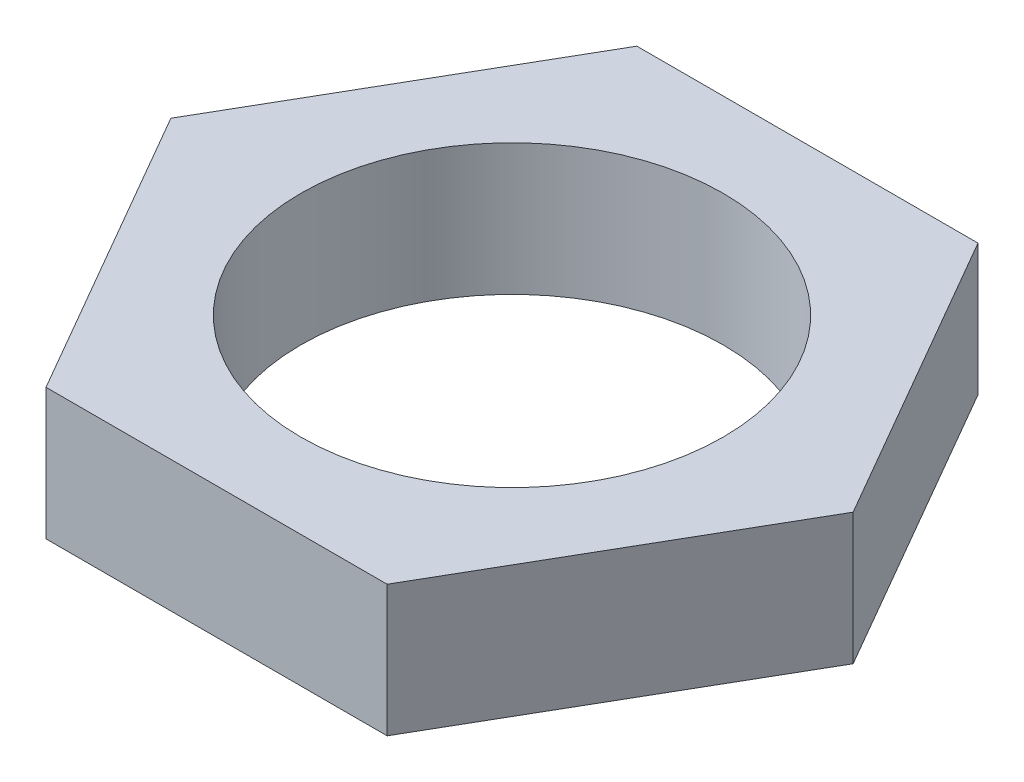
from build123d import *

# Parameters (mm, degrees)
ESQUISSE1_R      = 9.65
EXTRUSION1_DEPTH = 6


with BuildPart() as part:
    # Esquisse1 → Extrusion1 (new body)
    with BuildSketch(Plane(origin=(0, 0, 0), x_dir=(1, 0, 0), z_dir=(0, 1, 0))):
        Polygon((7.794228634, -13.5), (15.588457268, 0), (7.794228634, 13.5), (-7.794228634, 13.5), (-15.588457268, 0), (-7.794228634, -13.5), align=None)
        with Locations(Location((0, 0, 0), (0, 0, 270))):
            Circle(ESQUISSE1_R, mode=Mode.SUBTRACT)
    extrude(amount=EXTRUSION1_DEPTH)


solid = part.part
